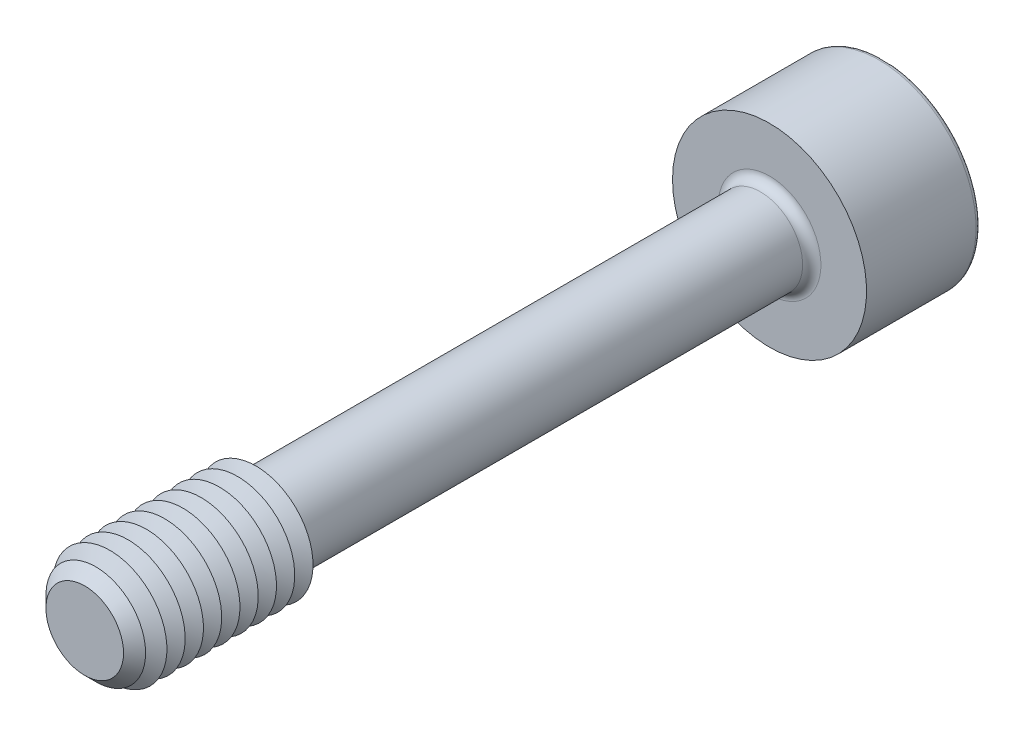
from build123d import *

# Parameters (mm, degrees)
SKETCH1_R       = 1.85
EXTRUDE1_DEPTH  = 15
CHAMFER1_SIZE   = 0.8
SKETCH3_R       = 4.25
EXTRUDE2_DEPTH  = 5
EXTRUDE3_DEPTH  = 4
FILLET1_R       = 0.4
FILLET2_R       = 0.2
LPATTERN1_COUNT = 9
LPATTERN1_PITCH = 0.8


with BuildPart() as part:
    # Sketch1 → Extrude1 (new, symmetric)
    with BuildSketch(Plane.XY):
        Circle(SKETCH1_R)
    extrude(amount=EXTRUDE1_DEPTH, both=True)

    # Sketch2 → Revolve1 (revolve)
    with BuildSketch(Plane(origin=(0, 0, 0), x_dir=(0, 0, -1), z_dir=(1, 0, 0))):
        Polygon((-15, 0), (-15, 2.5), (-7.5, 2.5), (-7.124722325, 1.85), (-7.124722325, 0), align=None)
    revolve(axis=Axis((0, 0, 7.124722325), (0, 0, 1)))

    # Chamfer1
    chamfer1_edges = [part.edges().sort_by_distance(p)[0] for p in [
        (0, -2.5, 15),
    ]]
    chamfer(chamfer1_edges, length=CHAMFER1_SIZE)

    # Sketch3 → Extrude2 (add)
    with BuildSketch(Plane(origin=(0, 0, -15), x_dir=(-1, 0, 0), z_dir=(0, 0, -1))):
        Circle(SKETCH3_R)
    extrude(amount=EXTRUDE2_DEPTH)

    # Sketch4 → Extrude3 (cut)
    with BuildSketch(Plane(origin=(-13.7, 0, -20), x_dir=(1, 0, 0), z_dir=(0, 0, 1))):
        Polygon((12.545299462, -2), (14.854700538, -2), (16.009401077, 0), (14.854700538, 2), (12.545299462, 2), (11.390598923, 0), align=None)
    extrude(amount=EXTRUDE3_DEPTH, mode=Mode.SUBTRACT)

    # Fillet1
    fillet1_edges = [part.edges().sort_by_distance(p)[0] for p in [
        (-1.85, 0, -15),
    ]]
    fillet(fillet1_edges, radius=FILLET1_R)

    # Fillet2
    fillet2_edges = [part.edges().sort_by_distance(p)[0] for p in [
        (4.25, 0, -20),
    ]]
    fillet(fillet2_edges, radius=FILLET2_R)

    # Sketch5 → Cut-Revolve1 (revolve, cut)
    with BuildSketch(Plane(origin=(0, 0, 0), x_dir=(0, 0, -1), z_dir=(1, 0, 0)), mode=Mode.PRIVATE) as cut_revolve1_sk:
        Polygon((16, 0), (16, -2), (14.845299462, 0), align=None)
    revolve(cut_revolve1_sk.sketch.rotate(Axis((0, 0, -14.845299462), (0, 0, -1)), 90), axis=Axis((0, 0, -14.845299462), (0, 0, -1)), mode=Mode.SUBTRACT)

    # Sketch7 → Cut-Revolve2 (revolve, cut)
    with BuildSketch(Plane(origin=(0, 0, 0), x_dir=(0, 0, -1), z_dir=(1, 0, 0)), mode=Mode.PRIVATE) as cut_revolve2_sk:
        Polygon((-7.5, 2.5), (-7.9, 1.807179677), (-8.3, 2.5), align=None)
    cut_revolve2 = revolve(cut_revolve2_sk.sketch.rotate(Axis((0, 0, -1.332048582), (0, 0, 1)), 90), axis=Axis((0, 0, -1.332048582), (0, 0, 1)), mode=Mode.SUBTRACT)

    # LPattern1: Cut-Revolve2 ×9
    with Locations(*[(0, 0, i * LPATTERN1_PITCH) for i in range(1, LPATTERN1_COUNT)]):
        add(cut_revolve2, mode=Mode.SUBTRACT)


solid = part.part
